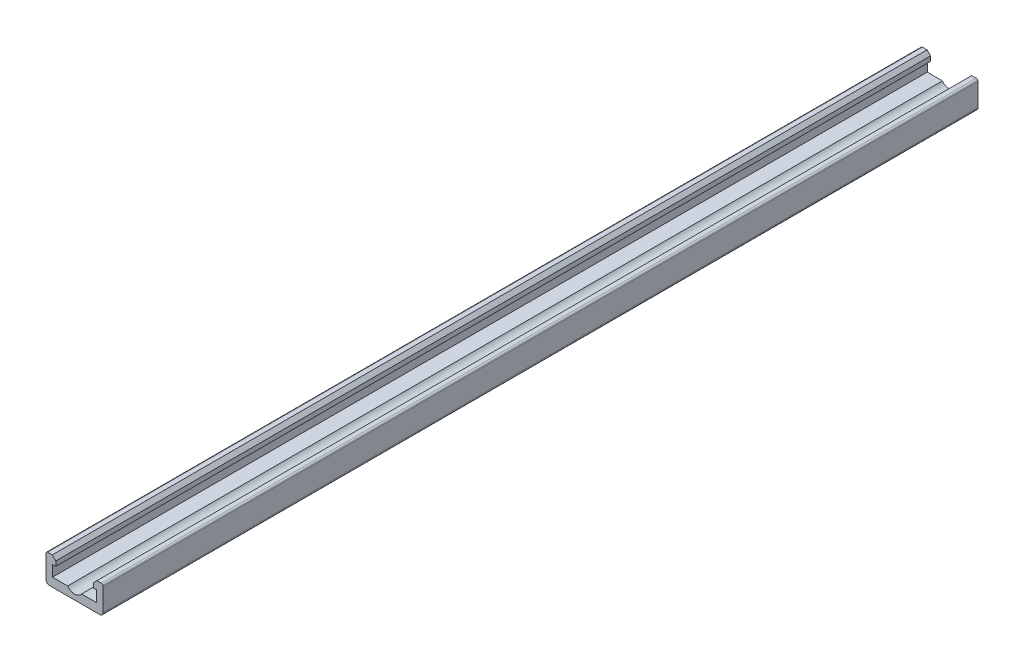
ISO-10303-21;
HEADER;
FILE_DESCRIPTION(('STEP AP214'),'2;1');
FILE_NAME('part.step','',(''),(''),'','','');
FILE_SCHEMA(('AUTOMOTIVE_DESIGN { 1 0 10303 214 1 1 1 1 }'));
ENDSEC;
DATA;
#1=APPLICATION_CONTEXT('core data for automotive mechanical design processes');
#2=APPLICATION_PROTOCOL_DEFINITION('international standard','automotive_design',2000,#1);
#3=PRODUCT_CONTEXT('',#1,'mechanical');
#4=PRODUCT('Part','Part','',(#3));
#5=PRODUCT_RELATED_PRODUCT_CATEGORY('part','',(#4));
#6=PRODUCT_DEFINITION_FORMATION('','',#4);
#7=PRODUCT_DEFINITION_CONTEXT('part definition',#1,'design');
#8=PRODUCT_DEFINITION('design','',#6,#7);
#9=PRODUCT_DEFINITION_SHAPE('','',#8);
#10=(LENGTH_UNIT() NAMED_UNIT(*) SI_UNIT(.MILLI.,.METRE.));
#11=(NAMED_UNIT(*) PLANE_ANGLE_UNIT() SI_UNIT($,.RADIAN.));
#12=(NAMED_UNIT(*) SI_UNIT($,.STERADIAN.) SOLID_ANGLE_UNIT());
#13=UNCERTAINTY_MEASURE_WITH_UNIT(LENGTH_MEASURE(1.E-05),#10,'distance_accuracy_value','');
#14=(GEOMETRIC_REPRESENTATION_CONTEXT(3) GLOBAL_UNCERTAINTY_ASSIGNED_CONTEXT((#13)) GLOBAL_UNIT_ASSIGNED_CONTEXT((#10,
#11,#12)) REPRESENTATION_CONTEXT('',''));
#15=CARTESIAN_POINT('',(0.,0.,0.));
#16=DIRECTION('',(0.,0.,1.));
#17=DIRECTION('',(1.,0.,0.));
#18=AXIS2_PLACEMENT_3D('',#15,#16,#17);
#19=CARTESIAN_POINT('',(15.35,15.,500.));
#20=DIRECTION('',(0.,0.,-1.));
#21=DIRECTION('',(-1.,0.,0.));
#22=AXIS2_PLACEMENT_3D('',#19,#20,#21);
#23=CYLINDRICAL_SURFACE('',#22,1.);
#24=CARTESIAN_POINT('',(15.35,15.,0.));
#25=DIRECTION('',(0.,0.,1.));
#26=DIRECTION('',(-1.,0.,0.));
#27=AXIS2_PLACEMENT_3D('',#24,#25,#26);
#28=CIRCLE('',#27,1.);
#29=CARTESIAN_POINT('',(16.35,15.,0.));
#30=VERTEX_POINT('',#29);
#31=CARTESIAN_POINT('',(15.35,16.,0.));
#32=VERTEX_POINT('',#31);
#33=EDGE_CURVE('E182',#30,#32,#28,.T.);
#34=ORIENTED_EDGE('',*,*,#33,.T.);
#35=DIRECTION('',(0.,0.,-1.));
#36=VECTOR('',#35,1.);
#37=CARTESIAN_POINT('',(15.35,16.,500.));
#38=LINE('',#37,#36);
#39=CARTESIAN_POINT('',(15.35,16.,500.));
#40=VERTEX_POINT('',#39);
#41=EDGE_CURVE('E9',#40,#32,#38,.T.);
#42=ORIENTED_EDGE('',*,*,#41,.F.);
#43=CARTESIAN_POINT('',(15.35,15.,500.));
#44=DIRECTION('',(0.,0.,1.));
#45=DIRECTION('',(-1.,0.,0.));
#46=AXIS2_PLACEMENT_3D('',#43,#44,#45);
#47=CIRCLE('',#46,1.);
#48=CARTESIAN_POINT('',(16.35,15.,500.));
#49=VERTEX_POINT('',#48);
#50=EDGE_CURVE('E220',#49,#40,#47,.T.);
#51=ORIENTED_EDGE('',*,*,#50,.F.);
#52=DIRECTION('',(0.,0.,-1.));
#53=VECTOR('',#52,1.);
#54=CARTESIAN_POINT('',(16.35,15.,500.));
#55=LINE('',#54,#53);
#56=EDGE_CURVE('E178',#49,#30,#55,.T.);
#57=ORIENTED_EDGE('',*,*,#56,.T.);
#58=EDGE_LOOP('',(#34,#42,#51,#57));
#59=FACE_BOUND('',#58,.T.);
#60=ADVANCED_FACE('F14',(#59),#23,.T.);
#61=CARTESIAN_POINT('',(15.35,16.,500.));
#62=DIRECTION('',(0.,-1.,0.));
#63=DIRECTION('',(0.,0.,-1.));
#64=AXIS2_PLACEMENT_3D('',#61,#62,#63);
#65=PLANE('',#64);
#66=DIRECTION('',(-1.,0.,0.));
#67=VECTOR('',#66,1.);
#68=CARTESIAN_POINT('',(15.35,16.,0.));
#69=LINE('',#68,#67);
#70=CARTESIAN_POINT('',(12.75,16.,0.));
#71=VERTEX_POINT('',#70);
#72=EDGE_CURVE('E185',#32,#71,#69,.T.);
#73=ORIENTED_EDGE('',*,*,#72,.T.);
#74=DIRECTION('',(0.,0.,-1.));
#75=VECTOR('',#74,1.);
#76=CARTESIAN_POINT('',(12.75,16.,500.));
#77=LINE('',#76,#75);
#78=CARTESIAN_POINT('',(12.75,16.,500.));
#79=VERTEX_POINT('',#78);
#80=EDGE_CURVE('E22',#79,#71,#77,.T.);
#81=ORIENTED_EDGE('',*,*,#80,.F.);
#82=DIRECTION('',(-1.,0.,0.));
#83=VECTOR('',#82,1.);
#84=CARTESIAN_POINT('',(15.35,16.,500.));
#85=LINE('',#84,#83);
#86=EDGE_CURVE('E109',#40,#79,#85,.T.);
#87=ORIENTED_EDGE('',*,*,#86,.F.);
#88=ORIENTED_EDGE('',*,*,#41,.T.);
#89=EDGE_LOOP('',(#73,#81,#87,#88));
#90=FACE_BOUND('',#89,.T.);
#91=ADVANCED_FACE('F339',(#90),#65,.F.);
#92=CARTESIAN_POINT('',(12.75,16.,500.));
#93=DIRECTION('',(0.707106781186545,-0.707106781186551,0.));
#94=DIRECTION('',(0.707106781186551,0.707106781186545,0.));
#95=AXIS2_PLACEMENT_3D('',#92,#93,#94);
#96=PLANE('',#95);
#97=DIRECTION('',(-0.707106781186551,-0.707106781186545,0.));
#98=VECTOR('',#97,1.);
#99=CARTESIAN_POINT('',(12.75,16.,0.));
#100=LINE('',#99,#98);
#101=CARTESIAN_POINT('',(10.75,14.,0.));
#102=VERTEX_POINT('',#101);
#103=EDGE_CURVE('E187',#71,#102,#100,.T.);
#104=ORIENTED_EDGE('',*,*,#103,.T.);
#105=DIRECTION('',(0.,0.,-1.));
#106=VECTOR('',#105,1.);
#107=CARTESIAN_POINT('',(10.75,14.,500.));
#108=LINE('',#107,#106);
#109=CARTESIAN_POINT('',(10.75,14.,500.));
#110=VERTEX_POINT('',#109);
#111=EDGE_CURVE('E263',#110,#102,#108,.T.);
#112=ORIENTED_EDGE('',*,*,#111,.F.);
#113=DIRECTION('',(-0.707106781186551,-0.707106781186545,0.));
#114=VECTOR('',#113,1.);
#115=CARTESIAN_POINT('',(12.75,16.,500.));
#116=LINE('',#115,#114);
#117=EDGE_CURVE('E271',#79,#110,#116,.T.);
#118=ORIENTED_EDGE('',*,*,#117,.F.);
#119=ORIENTED_EDGE('',*,*,#80,.T.);
#120=EDGE_LOOP('',(#104,#112,#118,#119));
#121=FACE_BOUND('',#120,.T.);
#122=ADVANCED_FACE('F269',(#121),#96,.F.);
#123=CARTESIAN_POINT('',(10.75,14.,500.));
#124=DIRECTION('',(1.,0.,0.));
#125=DIRECTION('',(0.,0.,-1.));
#126=AXIS2_PLACEMENT_3D('',#123,#124,#125);
#127=PLANE('',#126);
#128=DIRECTION('',(0.,-1.,0.));
#129=VECTOR('',#128,1.);
#130=CARTESIAN_POINT('',(10.75,14.,0.));
#131=LINE('',#130,#129);
#132=CARTESIAN_POINT('',(10.75,11.3,0.));
#133=VERTEX_POINT('',#132);
#134=EDGE_CURVE('E189',#102,#133,#131,.T.);
#135=ORIENTED_EDGE('',*,*,#134,.T.);
#136=DIRECTION('',(0.,0.,-1.));
#137=VECTOR('',#136,1.);
#138=CARTESIAN_POINT('',(10.75,11.3,500.));
#139=LINE('',#138,#137);
#140=CARTESIAN_POINT('',(10.75,11.3,500.));
#141=VERTEX_POINT('',#140);
#142=EDGE_CURVE('E260',#141,#133,#139,.T.);
#143=ORIENTED_EDGE('',*,*,#142,.F.);
#144=DIRECTION('',(0.,-1.,0.));
#145=VECTOR('',#144,1.);
#146=CARTESIAN_POINT('',(10.75,14.,500.));
#147=LINE('',#146,#145);
#148=EDGE_CURVE('E289',#110,#141,#147,.T.);
#149=ORIENTED_EDGE('',*,*,#148,.F.);
#150=ORIENTED_EDGE('',*,*,#111,.T.);
#151=EDGE_LOOP('',(#135,#143,#149,#150));
#152=FACE_BOUND('',#151,.T.);
#153=ADVANCED_FACE('F280',(#152),#127,.F.);
#154=CARTESIAN_POINT('',(10.75,11.3,500.));
#155=DIRECTION('',(0.,1.,0.));
#156=DIRECTION('',(0.,0.,1.));
#157=AXIS2_PLACEMENT_3D('',#154,#155,#156);
#158=PLANE('',#157);
#159=DIRECTION('',(1.,0.,0.));
#160=VECTOR('',#159,1.);
#161=CARTESIAN_POINT('',(10.75,11.3,0.));
#162=LINE('',#161,#160);
#163=CARTESIAN_POINT('',(12.65,11.3,0.));
#164=VERTEX_POINT('',#163);
#165=EDGE_CURVE('E191',#133,#164,#162,.T.);
#166=ORIENTED_EDGE('',*,*,#165,.T.);
#167=DIRECTION('',(0.,0.,-1.));
#168=VECTOR('',#167,1.);
#169=CARTESIAN_POINT('',(12.65,11.3,500.));
#170=LINE('',#169,#168);
#171=CARTESIAN_POINT('',(12.65,11.3,500.));
#172=VERTEX_POINT('',#171);
#173=EDGE_CURVE('E257',#172,#164,#170,.T.);
#174=ORIENTED_EDGE('',*,*,#173,.F.);
#175=DIRECTION('',(1.,0.,0.));
#176=VECTOR('',#175,1.);
#177=CARTESIAN_POINT('',(10.75,11.3,500.));
#178=LINE('',#177,#176);
#179=EDGE_CURVE('E286',#141,#172,#178,.T.);
#180=ORIENTED_EDGE('',*,*,#179,.F.);
#181=ORIENTED_EDGE('',*,*,#142,.T.);
#182=EDGE_LOOP('',(#166,#174,#180,#181));
#183=FACE_BOUND('',#182,.T.);
#184=ADVANCED_FACE('F284',(#183),#158,.F.);
#185=CARTESIAN_POINT('',(12.65,11.3,500.));
#186=DIRECTION('',(1.,0.,0.));
#187=DIRECTION('',(0.,0.,-1.));
#188=AXIS2_PLACEMENT_3D('',#185,#186,#187);
#189=PLANE('',#188);
#190=DIRECTION('',(0.,-1.,0.));
#191=VECTOR('',#190,1.);
#192=CARTESIAN_POINT('',(12.65,11.3,0.));
#193=LINE('',#192,#191);
#194=CARTESIAN_POINT('',(12.65,5.,0.));
#195=VERTEX_POINT('',#194);
#196=EDGE_CURVE('E193',#164,#195,#193,.T.);
#197=ORIENTED_EDGE('',*,*,#196,.T.);
#198=DIRECTION('',(0.,0.,-1.));
#199=VECTOR('',#198,1.);
#200=CARTESIAN_POINT('',(12.65,5.,500.));
#201=LINE('',#200,#199);
#202=CARTESIAN_POINT('',(12.65,5.,500.));
#203=VERTEX_POINT('',#202);
#204=EDGE_CURVE('E254',#203,#195,#201,.T.);
#205=ORIENTED_EDGE('',*,*,#204,.F.);
#206=DIRECTION('',(0.,-1.,0.));
#207=VECTOR('',#206,1.);
#208=CARTESIAN_POINT('',(12.65,11.3,500.));
#209=LINE('',#208,#207);
#210=EDGE_CURVE('E288',#172,#203,#209,.T.);
#211=ORIENTED_EDGE('',*,*,#210,.F.);
#212=ORIENTED_EDGE('',*,*,#173,.T.);
#213=EDGE_LOOP('',(#197,#205,#211,#212));
#214=FACE_BOUND('',#213,.T.);
#215=ADVANCED_FACE('F352',(#214),#189,.F.);
#216=CARTESIAN_POINT('',(12.65,5.,500.));
#217=DIRECTION('',(0.,-1.,0.));
#218=DIRECTION('',(0.,0.,-1.));
#219=AXIS2_PLACEMENT_3D('',#216,#217,#218);
#220=PLANE('',#219);
#221=DIRECTION('',(-1.,0.,0.));
#222=VECTOR('',#221,1.);
#223=CARTESIAN_POINT('',(12.65,5.,0.));
#224=LINE('',#223,#222);
#225=CARTESIAN_POINT('',(4.,5.,0.));
#226=VERTEX_POINT('',#225);
#227=EDGE_CURVE('E195',#195,#226,#224,.T.);
#228=ORIENTED_EDGE('',*,*,#227,.T.);
#229=DIRECTION('',(0.,0.,-1.));
#230=VECTOR('',#229,1.);
#231=CARTESIAN_POINT('',(4.,5.,500.));
#232=LINE('',#231,#230);
#233=CARTESIAN_POINT('',(4.,5.,500.));
#234=VERTEX_POINT('',#233);
#235=EDGE_CURVE('E251',#234,#226,#232,.T.);
#236=ORIENTED_EDGE('',*,*,#235,.F.);
#237=DIRECTION('',(-1.,0.,0.));
#238=VECTOR('',#237,1.);
#239=CARTESIAN_POINT('',(12.65,5.,500.));
#240=LINE('',#239,#238);
#241=EDGE_CURVE('E291',#203,#234,#240,.T.);
#242=ORIENTED_EDGE('',*,*,#241,.F.);
#243=ORIENTED_EDGE('',*,*,#204,.T.);
#244=EDGE_LOOP('',(#228,#236,#242,#243));
#245=FACE_BOUND('',#244,.T.);
#246=ADVANCED_FACE('F355',(#245),#220,.F.);
#247=CARTESIAN_POINT('',(0.,8.,500.));
#248=DIRECTION('',(0.,0.,-1.));
#249=DIRECTION('',(-1.,0.,0.));
#250=AXIS2_PLACEMENT_3D('',#247,#248,#249);
#251=CYLINDRICAL_SURFACE('',#250,5.);
#252=CARTESIAN_POINT('',(0.,8.,0.));
#253=DIRECTION('',(0.,0.,-1.));
#254=DIRECTION('',(-1.,0.,0.));
#255=AXIS2_PLACEMENT_3D('',#252,#253,#254);
#256=CIRCLE('',#255,5.);
#257=CARTESIAN_POINT('',(-4.,5.,0.));
#258=VERTEX_POINT('',#257);
#259=EDGE_CURVE('E197',#226,#258,#256,.T.);
#260=ORIENTED_EDGE('',*,*,#259,.T.);
#261=DIRECTION('',(0.,0.,-1.));
#262=VECTOR('',#261,1.);
#263=CARTESIAN_POINT('',(-4.,5.,500.));
#264=LINE('',#263,#262);
#265=CARTESIAN_POINT('',(-4.,5.,500.));
#266=VERTEX_POINT('',#265);
#267=EDGE_CURVE('E248',#266,#258,#264,.T.);
#268=ORIENTED_EDGE('',*,*,#267,.F.);
#269=CARTESIAN_POINT('',(0.,8.,500.));
#270=DIRECTION('',(0.,0.,-1.));
#271=DIRECTION('',(-1.,0.,0.));
#272=AXIS2_PLACEMENT_3D('',#269,#270,#271);
#273=CIRCLE('',#272,5.);
#274=EDGE_CURVE('E297',#234,#266,#273,.T.);
#275=ORIENTED_EDGE('',*,*,#274,.F.);
#276=ORIENTED_EDGE('',*,*,#235,.T.);
#277=EDGE_LOOP('',(#260,#268,#275,#276));
#278=FACE_BOUND('',#277,.T.);
#279=ADVANCED_FACE('F359',(#278),#251,.F.);
#280=CARTESIAN_POINT('',(-4.,5.,500.));
#281=DIRECTION('',(0.,-1.,0.));
#282=DIRECTION('',(0.,0.,-1.));
#283=AXIS2_PLACEMENT_3D('',#280,#281,#282);
#284=PLANE('',#283);
#285=DIRECTION('',(-1.,0.,0.));
#286=VECTOR('',#285,1.);
#287=CARTESIAN_POINT('',(-4.,5.,0.));
#288=LINE('',#287,#286);
#289=CARTESIAN_POINT('',(-12.65,5.,0.));
#290=VERTEX_POINT('',#289);
#291=EDGE_CURVE('E199',#258,#290,#288,.T.);
#292=ORIENTED_EDGE('',*,*,#291,.T.);
#293=DIRECTION('',(0.,0.,-1.));
#294=VECTOR('',#293,1.);
#295=CARTESIAN_POINT('',(-12.65,5.,500.));
#296=LINE('',#295,#294);
#297=CARTESIAN_POINT('',(-12.65,5.,500.));
#298=VERTEX_POINT('',#297);
#299=EDGE_CURVE('E245',#298,#290,#296,.T.);
#300=ORIENTED_EDGE('',*,*,#299,.F.);
#301=DIRECTION('',(-1.,0.,0.));
#302=VECTOR('',#301,1.);
#303=CARTESIAN_POINT('',(-4.,5.,500.));
#304=LINE('',#303,#302);
#305=EDGE_CURVE('E299',#266,#298,#304,.T.);
#306=ORIENTED_EDGE('',*,*,#305,.F.);
#307=ORIENTED_EDGE('',*,*,#267,.T.);
#308=EDGE_LOOP('',(#292,#300,#306,#307));
#309=FACE_BOUND('',#308,.T.);
#310=ADVANCED_FACE('F363',(#309),#284,.F.);
#311=CARTESIAN_POINT('',(-12.65,5.,500.));
#312=DIRECTION('',(-1.,0.,0.));
#313=DIRECTION('',(0.,0.,1.));
#314=AXIS2_PLACEMENT_3D('',#311,#312,#313);
#315=PLANE('',#314);
#316=DIRECTION('',(0.,1.,0.));
#317=VECTOR('',#316,1.);
#318=CARTESIAN_POINT('',(-12.65,5.,0.));
#319=LINE('',#318,#317);
#320=CARTESIAN_POINT('',(-12.65,11.3,0.));
#321=VERTEX_POINT('',#320);
#322=EDGE_CURVE('E201',#290,#321,#319,.T.);
#323=ORIENTED_EDGE('',*,*,#322,.T.);
#324=DIRECTION('',(0.,0.,-1.));
#325=VECTOR('',#324,1.);
#326=CARTESIAN_POINT('',(-12.65,11.3,500.));
#327=LINE('',#326,#325);
#328=CARTESIAN_POINT('',(-12.65,11.3,500.));
#329=VERTEX_POINT('',#328);
#330=EDGE_CURVE('E242',#329,#321,#327,.T.);
#331=ORIENTED_EDGE('',*,*,#330,.F.);
#332=DIRECTION('',(0.,1.,0.));
#333=VECTOR('',#332,1.);
#334=CARTESIAN_POINT('',(-12.65,5.,500.));
#335=LINE('',#334,#333);
#336=EDGE_CURVE('E301',#298,#329,#335,.T.);
#337=ORIENTED_EDGE('',*,*,#336,.F.);
#338=ORIENTED_EDGE('',*,*,#299,.T.);
#339=EDGE_LOOP('',(#323,#331,#337,#338));
#340=FACE_BOUND('',#339,.T.);
#341=ADVANCED_FACE('F367',(#340),#315,.F.);
#342=CARTESIAN_POINT('',(-12.65,11.3,500.));
#343=DIRECTION('',(0.,1.,0.));
#344=DIRECTION('',(0.,0.,1.));
#345=AXIS2_PLACEMENT_3D('',#342,#343,#344);
#346=PLANE('',#345);
#347=DIRECTION('',(1.,0.,0.));
#348=VECTOR('',#347,1.);
#349=CARTESIAN_POINT('',(-12.65,11.3,0.));
#350=LINE('',#349,#348);
#351=CARTESIAN_POINT('',(-10.75,11.3,0.));
#352=VERTEX_POINT('',#351);
#353=EDGE_CURVE('E203',#321,#352,#350,.T.);
#354=ORIENTED_EDGE('',*,*,#353,.T.);
#355=DIRECTION('',(0.,0.,-1.));
#356=VECTOR('',#355,1.);
#357=CARTESIAN_POINT('',(-10.75,11.3,500.));
#358=LINE('',#357,#356);
#359=CARTESIAN_POINT('',(-10.75,11.3,500.));
#360=VERTEX_POINT('',#359);
#361=EDGE_CURVE('E239',#360,#352,#358,.T.);
#362=ORIENTED_EDGE('',*,*,#361,.F.);
#363=DIRECTION('',(1.,0.,0.));
#364=VECTOR('',#363,1.);
#365=CARTESIAN_POINT('',(-12.65,11.3,500.));
#366=LINE('',#365,#364);
#367=EDGE_CURVE('E303',#329,#360,#366,.T.);
#368=ORIENTED_EDGE('',*,*,#367,.F.);
#369=ORIENTED_EDGE('',*,*,#330,.T.);
#370=EDGE_LOOP('',(#354,#362,#368,#369));
#371=FACE_BOUND('',#370,.T.);
#372=ADVANCED_FACE('F371',(#371),#346,.F.);
#373=CARTESIAN_POINT('',(-10.75,11.3,500.));
#374=DIRECTION('',(-1.,0.,0.));
#375=DIRECTION('',(0.,0.,1.));
#376=AXIS2_PLACEMENT_3D('',#373,#374,#375);
#377=PLANE('',#376);
#378=DIRECTION('',(0.,1.,0.));
#379=VECTOR('',#378,1.);
#380=CARTESIAN_POINT('',(-10.75,11.3,0.));
#381=LINE('',#380,#379);
#382=CARTESIAN_POINT('',(-10.75,14.,0.));
#383=VERTEX_POINT('',#382);
#384=EDGE_CURVE('E205',#352,#383,#381,.T.);
#385=ORIENTED_EDGE('',*,*,#384,.T.);
#386=DIRECTION('',(0.,0.,-1.));
#387=VECTOR('',#386,1.);
#388=CARTESIAN_POINT('',(-10.75,14.,500.));
#389=LINE('',#388,#387);
#390=CARTESIAN_POINT('',(-10.75,14.,500.));
#391=VERTEX_POINT('',#390);
#392=EDGE_CURVE('E236',#391,#383,#389,.T.);
#393=ORIENTED_EDGE('',*,*,#392,.F.);
#394=DIRECTION('',(0.,1.,0.));
#395=VECTOR('',#394,1.);
#396=CARTESIAN_POINT('',(-10.75,11.3,500.));
#397=LINE('',#396,#395);
#398=EDGE_CURVE('E305',#360,#391,#397,.T.);
#399=ORIENTED_EDGE('',*,*,#398,.F.);
#400=ORIENTED_EDGE('',*,*,#361,.T.);
#401=EDGE_LOOP('',(#385,#393,#399,#400));
#402=FACE_BOUND('',#401,.T.);
#403=ADVANCED_FACE('F375',(#402),#377,.F.);
#404=CARTESIAN_POINT('',(-10.75,14.,500.));
#405=DIRECTION('',(-0.707106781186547,-0.707106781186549,0.));
#406=DIRECTION('',(0.707106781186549,-0.707106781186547,0.));
#407=AXIS2_PLACEMENT_3D('',#404,#405,#406);
#408=PLANE('',#407);
#409=DIRECTION('',(-0.707106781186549,0.707106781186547,0.));
#410=VECTOR('',#409,1.);
#411=CARTESIAN_POINT('',(-10.75,14.,0.));
#412=LINE('',#411,#410);
#413=CARTESIAN_POINT('',(-12.75,16.,0.));
#414=VERTEX_POINT('',#413);
#415=EDGE_CURVE('E207',#383,#414,#412,.T.);
#416=ORIENTED_EDGE('',*,*,#415,.T.);
#417=DIRECTION('',(0.,0.,-1.));
#418=VECTOR('',#417,1.);
#419=CARTESIAN_POINT('',(-12.75,16.,500.));
#420=LINE('',#419,#418);
#421=CARTESIAN_POINT('',(-12.75,16.,500.));
#422=VERTEX_POINT('',#421);
#423=EDGE_CURVE('E233',#422,#414,#420,.T.);
#424=ORIENTED_EDGE('',*,*,#423,.F.);
#425=DIRECTION('',(-0.707106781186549,0.707106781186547,0.));
#426=VECTOR('',#425,1.);
#427=CARTESIAN_POINT('',(-10.75,14.,500.));
#428=LINE('',#427,#426);
#429=EDGE_CURVE('E307',#391,#422,#428,.T.);
#430=ORIENTED_EDGE('',*,*,#429,.F.);
#431=ORIENTED_EDGE('',*,*,#392,.T.);
#432=EDGE_LOOP('',(#416,#424,#430,#431));
#433=FACE_BOUND('',#432,.T.);
#434=ADVANCED_FACE('F379',(#433),#408,.F.);
#435=CARTESIAN_POINT('',(-12.75,16.,500.));
#436=DIRECTION('',(0.,-1.,0.));
#437=DIRECTION('',(0.,0.,-1.));
#438=AXIS2_PLACEMENT_3D('',#435,#436,#437);
#439=PLANE('',#438);
#440=DIRECTION('',(-1.,0.,0.));
#441=VECTOR('',#440,1.);
#442=CARTESIAN_POINT('',(-12.75,16.,0.));
#443=LINE('',#442,#441);
#444=CARTESIAN_POINT('',(-15.35,16.,0.));
#445=VERTEX_POINT('',#444);
#446=EDGE_CURVE('E209',#414,#445,#443,.T.);
#447=ORIENTED_EDGE('',*,*,#446,.T.);
#448=DIRECTION('',(0.,0.,-1.));
#449=VECTOR('',#448,1.);
#450=CARTESIAN_POINT('',(-15.35,16.,500.));
#451=LINE('',#450,#449);
#452=CARTESIAN_POINT('',(-15.35,16.,500.));
#453=VERTEX_POINT('',#452);
#454=EDGE_CURVE('E230',#453,#445,#451,.T.);
#455=ORIENTED_EDGE('',*,*,#454,.F.);
#456=DIRECTION('',(-1.,0.,0.));
#457=VECTOR('',#456,1.);
#458=CARTESIAN_POINT('',(-12.75,16.,500.));
#459=LINE('',#458,#457);
#460=EDGE_CURVE('E309',#422,#453,#459,.T.);
#461=ORIENTED_EDGE('',*,*,#460,.F.);
#462=ORIENTED_EDGE('',*,*,#423,.T.);
#463=EDGE_LOOP('',(#447,#455,#461,#462));
#464=FACE_BOUND('',#463,.T.);
#465=ADVANCED_FACE('F383',(#464),#439,.F.);
#466=CARTESIAN_POINT('',(-15.35,15.,500.));
#467=DIRECTION('',(0.,0.,-1.));
#468=DIRECTION('',(-1.,0.,0.));
#469=AXIS2_PLACEMENT_3D('',#466,#467,#468);
#470=CYLINDRICAL_SURFACE('',#469,1.);
#471=CARTESIAN_POINT('',(-15.35,15.,0.));
#472=DIRECTION('',(0.,0.,1.));
#473=DIRECTION('',(-1.,0.,0.));
#474=AXIS2_PLACEMENT_3D('',#471,#472,#473);
#475=CIRCLE('',#474,1.);
#476=CARTESIAN_POINT('',(-16.35,15.,0.));
#477=VERTEX_POINT('',#476);
#478=EDGE_CURVE('E211',#445,#477,#475,.T.);
#479=ORIENTED_EDGE('',*,*,#478,.T.);
#480=DIRECTION('',(0.,0.,-1.));
#481=VECTOR('',#480,1.);
#482=CARTESIAN_POINT('',(-16.35,15.,500.));
#483=LINE('',#482,#481);
#484=CARTESIAN_POINT('',(-16.35,15.,500.));
#485=VERTEX_POINT('',#484);
#486=EDGE_CURVE('E227',#485,#477,#483,.T.);
#487=ORIENTED_EDGE('',*,*,#486,.F.);
#488=CARTESIAN_POINT('',(-15.35,15.,500.));
#489=DIRECTION('',(0.,0.,1.));
#490=DIRECTION('',(-1.,0.,0.));
#491=AXIS2_PLACEMENT_3D('',#488,#489,#490);
#492=CIRCLE('',#491,1.);
#493=EDGE_CURVE('E311',#453,#485,#492,.T.);
#494=ORIENTED_EDGE('',*,*,#493,.F.);
#495=ORIENTED_EDGE('',*,*,#454,.T.);
#496=EDGE_LOOP('',(#479,#487,#494,#495));
#497=FACE_BOUND('',#496,.T.);
#498=ADVANCED_FACE('F387',(#497),#470,.T.);
#499=CARTESIAN_POINT('',(-16.35,15.,500.));
#500=DIRECTION('',(1.,0.,0.));
#501=DIRECTION('',(0.,0.,-1.));
#502=AXIS2_PLACEMENT_3D('',#499,#500,#501);
#503=PLANE('',#502);
#504=DIRECTION('',(0.,-1.,0.));
#505=VECTOR('',#504,1.);
#506=CARTESIAN_POINT('',(-16.35,15.,0.));
#507=LINE('',#506,#505);
#508=CARTESIAN_POINT('',(-16.35,2.,0.));
#509=VERTEX_POINT('',#508);
#510=EDGE_CURVE('E213',#477,#509,#507,.T.);
#511=ORIENTED_EDGE('',*,*,#510,.T.);
#512=DIRECTION('',(0.,0.,-1.));
#513=VECTOR('',#512,1.);
#514=CARTESIAN_POINT('',(-16.35,2.,500.));
#515=LINE('',#514,#513);
#516=CARTESIAN_POINT('',(-16.35,2.,500.));
#517=VERTEX_POINT('',#516);
#518=EDGE_CURVE('E224',#517,#509,#515,.T.);
#519=ORIENTED_EDGE('',*,*,#518,.F.);
#520=DIRECTION('',(0.,-1.,0.));
#521=VECTOR('',#520,1.);
#522=CARTESIAN_POINT('',(-16.35,15.,500.));
#523=LINE('',#522,#521);
#524=EDGE_CURVE('E313',#485,#517,#523,.T.);
#525=ORIENTED_EDGE('',*,*,#524,.F.);
#526=ORIENTED_EDGE('',*,*,#486,.T.);
#527=EDGE_LOOP('',(#511,#519,#525,#526));
#528=FACE_BOUND('',#527,.T.);
#529=ADVANCED_FACE('F319',(#528),#503,.F.);
#530=CARTESIAN_POINT('',(-14.35,2.,500.));
#531=DIRECTION('',(0.,0.,-1.));
#532=DIRECTION('',(-1.,0.,0.));
#533=AXIS2_PLACEMENT_3D('',#530,#531,#532);
#534=CYLINDRICAL_SURFACE('',#533,2.);
#535=CARTESIAN_POINT('',(-14.35,2.,0.));
#536=DIRECTION('',(0.,0.,1.));
#537=DIRECTION('',(-1.,0.,0.));
#538=AXIS2_PLACEMENT_3D('',#535,#536,#537);
#539=CIRCLE('',#538,2.);
#540=CARTESIAN_POINT('',(-14.35,0.,0.));
#541=VERTEX_POINT('',#540);
#542=EDGE_CURVE('E215',#509,#541,#539,.T.);
#543=ORIENTED_EDGE('',*,*,#542,.T.);
#544=DIRECTION('',(0.,0.,-1.));
#545=VECTOR('',#544,1.);
#546=CARTESIAN_POINT('',(-14.35,0.,500.));
#547=LINE('',#546,#545);
#548=CARTESIAN_POINT('',(-14.35,0.,500.));
#549=VERTEX_POINT('',#548);
#550=EDGE_CURVE('E173',#549,#541,#547,.T.);
#551=ORIENTED_EDGE('',*,*,#550,.F.);
#552=CARTESIAN_POINT('',(-14.35,2.,500.));
#553=DIRECTION('',(0.,0.,1.));
#554=DIRECTION('',(-1.,0.,0.));
#555=AXIS2_PLACEMENT_3D('',#552,#553,#554);
#556=CIRCLE('',#555,2.);
#557=EDGE_CURVE('E164',#517,#549,#556,.T.);
#558=ORIENTED_EDGE('',*,*,#557,.F.);
#559=ORIENTED_EDGE('',*,*,#518,.T.);
#560=EDGE_LOOP('',(#543,#551,#558,#559));
#561=FACE_BOUND('',#560,.T.);
#562=ADVANCED_FACE('F323',(#561),#534,.T.);
#563=CARTESIAN_POINT('',(-14.35,0.,500.));
#564=DIRECTION('',(0.,1.,0.));
#565=DIRECTION('',(0.,0.,1.));
#566=AXIS2_PLACEMENT_3D('',#563,#564,#565);
#567=PLANE('',#566);
#568=DIRECTION('',(1.,0.,0.));
#569=VECTOR('',#568,1.);
#570=CARTESIAN_POINT('',(-14.35,0.,0.));
#571=LINE('',#570,#569);
#572=CARTESIAN_POINT('',(14.35,0.,0.));
#573=VERTEX_POINT('',#572);
#574=EDGE_CURVE('E172',#541,#573,#571,.T.);
#575=ORIENTED_EDGE('',*,*,#574,.T.);
#576=DIRECTION('',(0.,0.,-1.));
#577=VECTOR('',#576,1.);
#578=CARTESIAN_POINT('',(14.35,0.,500.));
#579=LINE('',#578,#577);
#580=CARTESIAN_POINT('',(14.35,0.,500.));
#581=VERTEX_POINT('',#580);
#582=EDGE_CURVE('E169',#581,#573,#579,.T.);
#583=ORIENTED_EDGE('',*,*,#582,.F.);
#584=DIRECTION('',(1.,0.,0.));
#585=VECTOR('',#584,1.);
#586=CARTESIAN_POINT('',(-14.35,0.,500.));
#587=LINE('',#586,#585);
#588=EDGE_CURVE('E158',#549,#581,#587,.T.);
#589=ORIENTED_EDGE('',*,*,#588,.F.);
#590=ORIENTED_EDGE('',*,*,#550,.T.);
#591=EDGE_LOOP('',(#575,#583,#589,#590));
#592=FACE_BOUND('',#591,.T.);
#593=ADVANCED_FACE('F170',(#592),#567,.F.);
#594=CARTESIAN_POINT('',(14.35,2.,500.));
#595=DIRECTION('',(0.,0.,-1.));
#596=DIRECTION('',(-1.,0.,0.));
#597=AXIS2_PLACEMENT_3D('',#594,#595,#596);
#598=CYLINDRICAL_SURFACE('',#597,2.);
#599=CARTESIAN_POINT('',(14.35,2.,0.));
#600=DIRECTION('',(0.,0.,1.));
#601=DIRECTION('',(-1.,0.,0.));
#602=AXIS2_PLACEMENT_3D('',#599,#600,#601);
#603=CIRCLE('',#602,2.);
#604=CARTESIAN_POINT('',(16.35,2.,0.));
#605=VERTEX_POINT('',#604);
#606=EDGE_CURVE('E95',#573,#605,#603,.T.);
#607=ORIENTED_EDGE('',*,*,#606,.T.);
#608=DIRECTION('',(0.,0.,-1.));
#609=VECTOR('',#608,1.);
#610=CARTESIAN_POINT('',(16.35,2.,500.));
#611=LINE('',#610,#609);
#612=CARTESIAN_POINT('',(16.35,2.,500.));
#613=VERTEX_POINT('',#612);
#614=EDGE_CURVE('E174',#613,#605,#611,.T.);
#615=ORIENTED_EDGE('',*,*,#614,.F.);
#616=CARTESIAN_POINT('',(14.35,2.,500.));
#617=DIRECTION('',(0.,0.,1.));
#618=DIRECTION('',(-1.,0.,0.));
#619=AXIS2_PLACEMENT_3D('',#616,#617,#618);
#620=CIRCLE('',#619,2.);
#621=EDGE_CURVE('E162',#581,#613,#620,.T.);
#622=ORIENTED_EDGE('',*,*,#621,.F.);
#623=ORIENTED_EDGE('',*,*,#582,.T.);
#624=EDGE_LOOP('',(#607,#615,#622,#623));
#625=FACE_BOUND('',#624,.T.);
#626=ADVANCED_FACE('F176',(#625),#598,.T.);
#627=CARTESIAN_POINT('',(16.35,2.,500.));
#628=DIRECTION('',(-1.,0.,0.));
#629=DIRECTION('',(0.,0.,1.));
#630=AXIS2_PLACEMENT_3D('',#627,#628,#629);
#631=PLANE('',#630);
#632=DIRECTION('',(0.,1.,0.));
#633=VECTOR('',#632,1.);
#634=CARTESIAN_POINT('',(16.35,2.,0.));
#635=LINE('',#634,#633);
#636=EDGE_CURVE('E101',#605,#30,#635,.T.);
#637=ORIENTED_EDGE('',*,*,#636,.T.);
#638=ORIENTED_EDGE('',*,*,#56,.F.);
#639=DIRECTION('',(0.,1.,0.));
#640=VECTOR('',#639,1.);
#641=CARTESIAN_POINT('',(16.35,2.,500.));
#642=LINE('',#641,#640);
#643=EDGE_CURVE('E30',#613,#49,#642,.T.);
#644=ORIENTED_EDGE('',*,*,#643,.F.);
#645=ORIENTED_EDGE('',*,*,#614,.T.);
#646=EDGE_LOOP('',(#637,#638,#644,#645));
#647=FACE_BOUND('',#646,.T.);
#648=ADVANCED_FACE('F327',(#647),#631,.F.);
#649=CARTESIAN_POINT('',(15.35,15.,500.));
#650=DIRECTION('',(0.,0.,-1.));
#651=DIRECTION('',(-1.,0.,0.));
#652=AXIS2_PLACEMENT_3D('',#649,#650,#651);
#653=PLANE('',#652);
#654=ORIENTED_EDGE('',*,*,#50,.T.);
#655=ORIENTED_EDGE('',*,*,#86,.T.);
#656=ORIENTED_EDGE('',*,*,#117,.T.);
#657=ORIENTED_EDGE('',*,*,#148,.T.);
#658=ORIENTED_EDGE('',*,*,#179,.T.);
#659=ORIENTED_EDGE('',*,*,#210,.T.);
#660=ORIENTED_EDGE('',*,*,#241,.T.);
#661=ORIENTED_EDGE('',*,*,#274,.T.);
#662=ORIENTED_EDGE('',*,*,#305,.T.);
#663=ORIENTED_EDGE('',*,*,#336,.T.);
#664=ORIENTED_EDGE('',*,*,#367,.T.);
#665=ORIENTED_EDGE('',*,*,#398,.T.);
#666=ORIENTED_EDGE('',*,*,#429,.T.);
#667=ORIENTED_EDGE('',*,*,#460,.T.);
#668=ORIENTED_EDGE('',*,*,#493,.T.);
#669=ORIENTED_EDGE('',*,*,#524,.T.);
#670=ORIENTED_EDGE('',*,*,#557,.T.);
#671=ORIENTED_EDGE('',*,*,#588,.T.);
#672=ORIENTED_EDGE('',*,*,#621,.T.);
#673=ORIENTED_EDGE('',*,*,#643,.T.);
#674=EDGE_LOOP('',(#654,#655,#656,#657,#658,#659,#660,#661,#662,#663,#664,#665,#666,#667,#668,
#669,#670,#671,#672,#673));
#675=FACE_BOUND('',#674,.T.);
#676=ADVANCED_FACE('F160',(#675),#653,.F.);
#677=CARTESIAN_POINT('',(15.35,15.,0.));
#678=DIRECTION('',(0.,0.,-1.));
#679=DIRECTION('',(-1.,0.,0.));
#680=AXIS2_PLACEMENT_3D('',#677,#678,#679);
#681=PLANE('',#680);
#682=ORIENTED_EDGE('',*,*,#33,.F.);
#683=ORIENTED_EDGE('',*,*,#636,.F.);
#684=ORIENTED_EDGE('',*,*,#606,.F.);
#685=ORIENTED_EDGE('',*,*,#574,.F.);
#686=ORIENTED_EDGE('',*,*,#542,.F.);
#687=ORIENTED_EDGE('',*,*,#510,.F.);
#688=ORIENTED_EDGE('',*,*,#478,.F.);
#689=ORIENTED_EDGE('',*,*,#446,.F.);
#690=ORIENTED_EDGE('',*,*,#415,.F.);
#691=ORIENTED_EDGE('',*,*,#384,.F.);
#692=ORIENTED_EDGE('',*,*,#353,.F.);
#693=ORIENTED_EDGE('',*,*,#322,.F.);
#694=ORIENTED_EDGE('',*,*,#291,.F.);
#695=ORIENTED_EDGE('',*,*,#259,.F.);
#696=ORIENTED_EDGE('',*,*,#227,.F.);
#697=ORIENTED_EDGE('',*,*,#196,.F.);
#698=ORIENTED_EDGE('',*,*,#165,.F.);
#699=ORIENTED_EDGE('',*,*,#134,.F.);
#700=ORIENTED_EDGE('',*,*,#103,.F.);
#701=ORIENTED_EDGE('',*,*,#72,.F.);
#702=EDGE_LOOP('',(#682,#683,#684,#685,#686,#687,#688,#689,#690,#691,#692,#693,#694,#695,#696,
#697,#698,#699,#700,#701));
#703=FACE_BOUND('',#702,.T.);
#704=ADVANCED_FACE('F275',(#703),#681,.T.);
#705=CLOSED_SHELL('',(#60,#91,#122,#153,#184,#215,#246,#279,#310,#341,#372,#403,#434,#465,#498,
#529,#562,#593,#626,#648,#676,#704));
#706=MANIFOLD_SOLID_BREP('B1',#705);
#707=ADVANCED_BREP_SHAPE_REPRESENTATION('',(#18,#706),#14);
#708=SHAPE_DEFINITION_REPRESENTATION(#9,#707);
ENDSEC;
END-ISO-10303-21;
